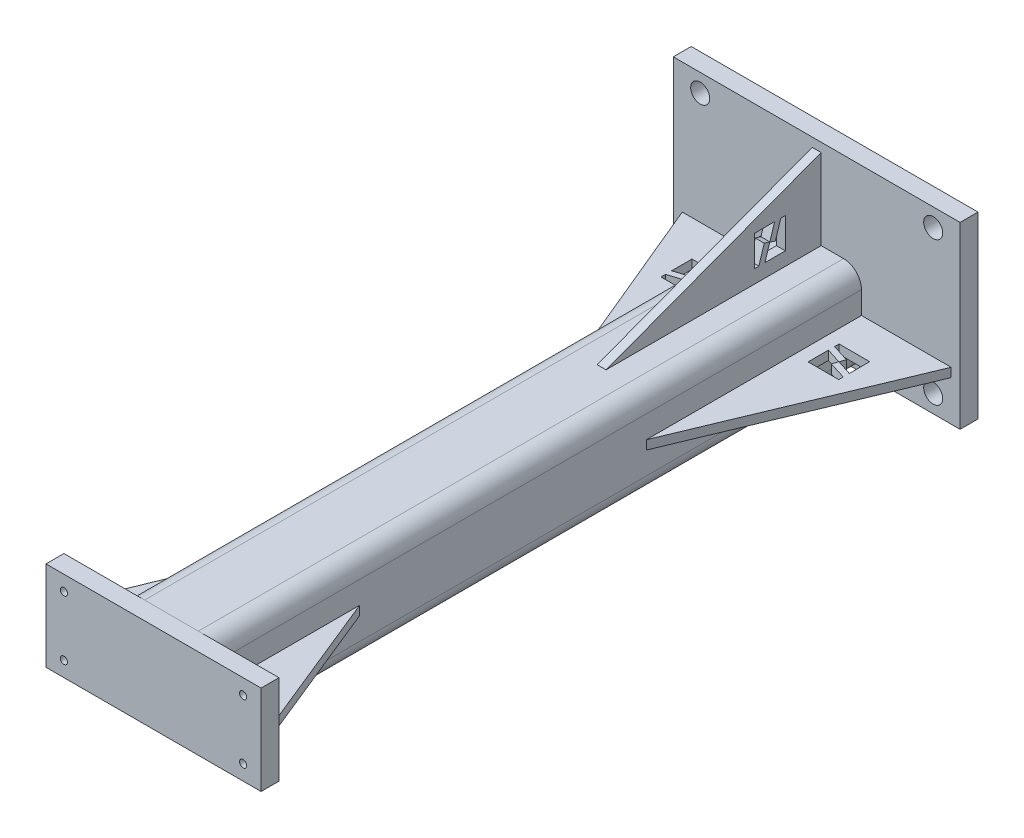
from build123d import *

# Parameters (mm, degrees)
TUBE_SQUARE_TS2_5X2_5X0_25_13_DEPTH = 457.2
SKETCH12_W                          = 203.2
SKETCH12_H                          = 127
BOSS_EXTRUDE1_DEPTH                 = 12.7
SKETCH14_W                          = 6.74624
SKETCH14_H                          = 12.7
F_1_2_CLEARANCE_HOLE1_AT_2_COUNT    = 2
F_1_2_CLEARANCE_HOLE1_AT_2_PITCH    = 101.6
F_1_2_CLEARANCE_HOLE1_AT_3_COUNT    = 2
F_1_2_CLEARANCE_HOLE1_AT_3_PITCH    = 193.857086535
F_1_2_CLEARANCE_HOLE1_AT_4_COUNT    = 2
F_1_2_CLEARANCE_HOLE1_AT_4_PITCH    = 165.1
GUSSET1_THICKNESS                   = 6.35
CUT_EXTRUDE1_DEPTH                  = 490.496042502
GUSSET2_THICKNESS                   = 6.35
CUT_EXTRUDE2_DEPTH                  = 491.77120242
SKETCH136_W                         = 152.4
SKETCH136_H                         = 63.5
BOSS_EXTRUDE2_DEPTH                 = 12.7
SKETCH138_W                         = 2.5527
SKETCH138_H                         = 12.7
F_10_CLEARANCE_HOLE1_AT_2_COUNT     = 2
F_10_CLEARANCE_HOLE1_AT_2_PITCH     = 42.0624
MIRROR4_COPY_1_SKETCH_W             = 2.5527
MIRROR4_COPY_1_SKETCH_H             = 12.7
BOSS_EXTRUDE3_DEPTH                 = 3.175


with BuildPart() as part:
    # Sketch131 → Tube _square_ TS2.5X2.5X0.25_13 (new body)
    with BuildSketch(Plane(origin=(0, 0, 0), x_dir=(1, 0, 0), z_dir=(0, 0, -1))):
        with BuildLine():
            Line((-19.05, -31.75), (19.05, -31.75))
            ThreePointArc((19.05, -31.75), (28.030256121, -28.030256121), (31.75, -19.05))
            Line((31.75, -19.05), (31.75, 19.05))
            ThreePointArc((31.75, 19.05), (28.030256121, 28.030256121), (19.05, 31.75))
            Line((19.05, 31.75), (-19.05, 31.75))
            ThreePointArc((-19.05, 31.75), (-28.030256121, 28.030256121), (-31.75, 19.05))
            Line((-31.75, 19.05), (-31.75, -19.05))
            ThreePointArc((-31.75, -19.05), (-28.030256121, -28.030256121), (-19.05, -31.75))
        make_face()
        with BuildLine():
            Line((-19.05, -25.4), (19.05, -25.4))
            ThreePointArc((19.05, -25.4), (23.540128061, -23.540128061), (25.4, -19.05))
            Line((25.4, -19.05), (25.4, 19.05))
            ThreePointArc((25.4, 19.05), (23.540128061, 23.540128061), (19.05, 25.4))
            Line((19.05, 25.4), (-19.05, 25.4))
            ThreePointArc((-19.05, 25.4), (-23.540128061, 23.540128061), (-25.4, 19.05))
            Line((-25.4, 19.05), (-25.4, -19.05))
            ThreePointArc((-25.4, -19.05), (-23.540128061, -23.540128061), (-19.05, -25.4))
        make_face(mode=Mode.SUBTRACT)
    extrude(amount=TUBE_SQUARE_TS2_5X2_5X0_25_13_DEPTH)


with BuildPart() as body_2:
    # Sketch12 → Boss-Extrude1 (new body)
    with BuildSketch(Plane(origin=(0, 0, -457.2), x_dir=(-1, 0, 0), z_dir=(0, 0, -1))):
        with Locations((0, 31.75)):
            Rectangle(SKETCH12_W, SKETCH12_H)
    extrude(amount=BOSS_EXTRUDE1_DEPTH)

    # Sketch14 → 1_2 Clearance Hole1 (revolve, cut)
    with BuildSketch(Plane(origin=(-82.55, 82.55, -457.2), x_dir=(0, -1, 0), z_dir=(1, 0, 0))):
        with Locations((3.37312, 6.35)):
            Rectangle(SKETCH14_W, SKETCH14_H)
    f_1_2_clearance_hole1 = revolve(axis=Axis((-82.55, 82.55, -450.85), (0, 0, -1)), mode=Mode.SUBTRACT)

    # 1_2 Clearance Hole1 at 2: 1_2 Clearance Hole1 ×2
    with Locations(*[(0, -i * F_1_2_CLEARANCE_HOLE1_AT_2_PITCH, 0) for i in range(1, F_1_2_CLEARANCE_HOLE1_AT_2_COUNT)]):
        add(f_1_2_clearance_hole1, mode=Mode.SUBTRACT)

    # 1_2 Clearance Hole1 at 3: 1_2 Clearance Hole1 ×2
    with Locations(*[Vector(0.8516583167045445, -0.5240974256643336, 0) * (i * F_1_2_CLEARANCE_HOLE1_AT_3_PITCH) for i in range(1, F_1_2_CLEARANCE_HOLE1_AT_3_COUNT)]):
        add(f_1_2_clearance_hole1, mode=Mode.SUBTRACT)

    # 1_2 Clearance Hole1 at 4: 1_2 Clearance Hole1 ×2
    with Locations(*[(i * F_1_2_CLEARANCE_HOLE1_AT_4_PITCH, 0, 0) for i in range(1, F_1_2_CLEARANCE_HOLE1_AT_4_COUNT)]):
        add(f_1_2_clearance_hole1, mode=Mode.SUBTRACT)


with BuildPart() as body_3:
    # Gusset1: a gusset: a plate 6.35 thick in the corner of two members, its outline drawn in place
    gusset1_outline = Wire([Line((-31.75, -3.175, -457.2), (-31.75, -3.175, -304.8)), Line((-31.75, -3.175, -304.8), (-95.25, -3.175, -457.2)), Line((-95.25, -3.175, -457.2), (-31.75, -3.175, -457.2))])
    add(extrude(Face(gusset1_outline), amount=GUSSET1_THICKNESS, dir=(0, 1, 0)))

    # Sketch134 → Cut-Extrude1 (cut, through all)
    with BuildSketch(Plane(origin=(0, 3.175, 0), x_dir=(1, 0, 0), z_dir=(0, 1, 0))):
        Polygon((-52.02378654, 420.834448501), (-50.814395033, 416.846590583), (-62.975254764, 413.010976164), (-62.975254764, 409.814048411), (-41.275, 409.814048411), (-41.275, 424.250735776), align=None)
        Polygon((-52.236625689, 420.76398402), (-53.440938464, 424.751841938), (-41.275, 428.587456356), (-41.275, 431.8), (-62.969389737, 431.8), (-63.007299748, 417.355504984), align=None)
    extrude(amount=-CUT_EXTRUDE1_DEPTH, mode=Mode.SUBTRACT)


with BuildPart() as body_4:
    # Gusset2: a gusset: a plate 6.35 thick in the corner of two members, its outline drawn in place
    gusset2_outline = Wire([Line((-3.175, 31.75, -457.2), (-3.175, 31.75, -304.8)), Line((-3.175, 31.75, -304.8), (-3.175, 88.9, -457.2)), Line((-3.175, 88.9, -457.2), (-3.175, 31.75, -457.2))])
    add(extrude(Face(gusset2_outline), amount=GUSSET2_THICKNESS, dir=(1, 0, 0)))

    # Sketch135 → Cut-Extrude2 (cut, through all)
    with BuildSketch(Plane.ZY.offset(3.175)):
        Polygon((-420.77959991, 52.02378654), (-424.767457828, 50.814395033), (-428.603072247, 62.975254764), (-431.8, 62.975254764), (-431.8, 41.275), (-417.363312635, 41.275), align=None)
        Polygon((-420.850064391, 52.236625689), (-416.862206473, 53.440938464), (-413.026592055, 41.275), (-409.814048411, 41.275), (-409.814048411, 62.969389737), (-424.258543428, 63.007299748), align=None)
    extrude(amount=-CUT_EXTRUDE2_DEPTH, mode=Mode.SUBTRACT)


with BuildPart() as body_5:
    # Mirror3: mirrored copy
    add(body_3.part.mirror(Plane.ZY))


with BuildPart() as body_6:
    # Sketch136 → Boss-Extrude2 (new body)
    with BuildSketch(Plane.XY):
        Rectangle(SKETCH136_W, SKETCH136_H)
    extrude(amount=BOSS_EXTRUDE2_DEPTH)

    # Sketch138 → 10 Clearance Hole1 (revolve, cut)
    with BuildSketch(Plane(origin=(-63.5, 21.0312, 0), x_dir=(0, 1, 0), z_dir=(1, 0, 0))):
        with Locations((1.27635, 6.35)):
            Rectangle(SKETCH138_W, SKETCH138_H)
    f_10_clearance_hole1 = revolve(axis=Axis((-63.5, 21.0312, -6.35), (0, 0, 1)), mode=Mode.SUBTRACT)

    # 10 Clearance Hole1 at 2: 10 Clearance Hole1 ×2
    with Locations(*[(0, -i * F_10_CLEARANCE_HOLE1_AT_2_PITCH, 0) for i in range(1, F_10_CLEARANCE_HOLE1_AT_2_COUNT)]):
        add(f_10_clearance_hole1, mode=Mode.SUBTRACT)

    # Mirror4: 10 Clearance Hole1 across plane
    add(f_10_clearance_hole1.mirror(Plane.ZY), mode=Mode.SUBTRACT)

    # Mirror4 copy 1 sketch → Mirror4 copy 1 (revolve, cut)
    with BuildSketch(Plane(origin=(63.5, -21.0312, 0), x_dir=(0, 1, 0), z_dir=(-1, 0, 0))):
        with Locations((1.27635, -6.35)):
            Rectangle(MIRROR4_COPY_1_SKETCH_W, MIRROR4_COPY_1_SKETCH_H)
    revolve(axis=Axis((63.5, -21.0312, -6.35), (0, 0, -1)), mode=Mode.SUBTRACT)


with BuildPart() as body_7:
    # Sketch139 → Boss-Extrude3 (new, symmetric)
    with BuildSketch(Plane(origin=(0, 0, 0), x_dir=(1, 0, 0), z_dir=(0, 1, 0))):
        Polygon((73.025, 0), (31.75, 101.6), (31.75, 0), align=None)
    extrude(amount=BOSS_EXTRUDE3_DEPTH, both=True)


with BuildPart() as body_8:
    # Mirror5: mirrored copy
    add(body_7.part.mirror(Plane.ZY))


solid = Compound([part.part, body_2.part, body_3.part, body_4.part, body_5.part, body_6.part, body_7.part, body_8.part])
